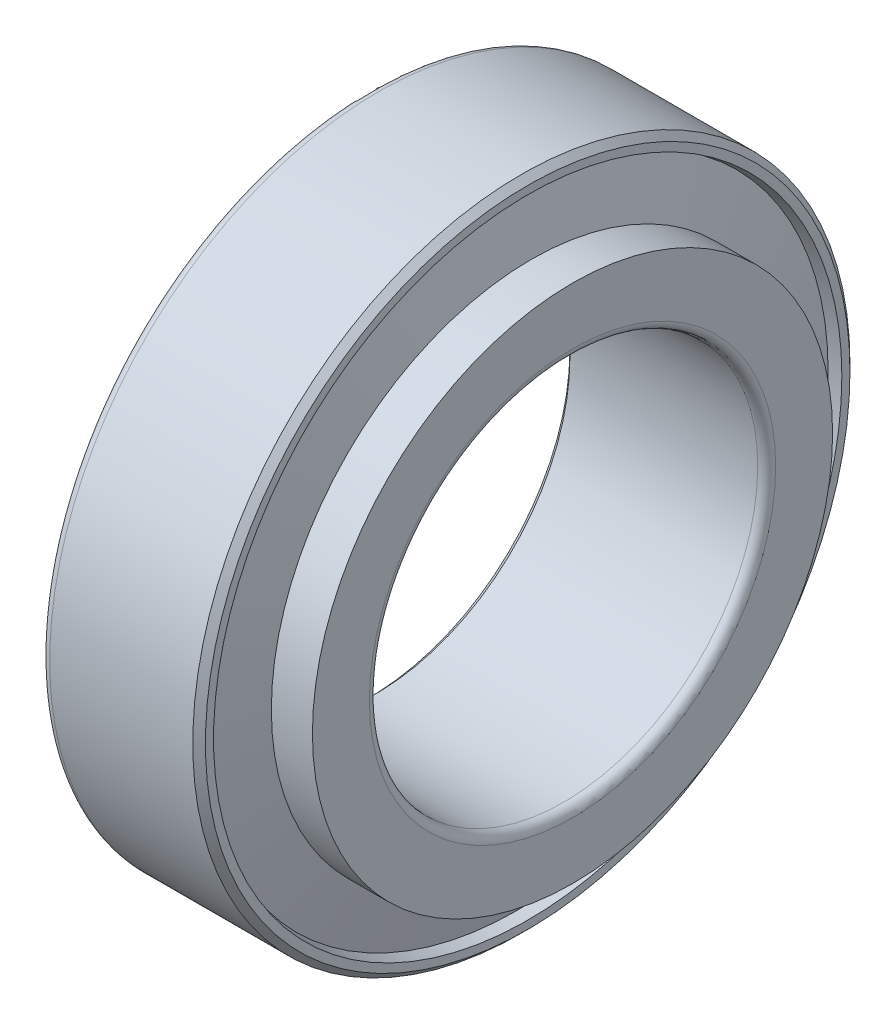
from build123d import *


with BuildPart() as part:
    # OutRacSke → OuterRace (revolve)
    with BuildSketch(Plane.XY, mode=Mode.PRIVATE) as outerrace_sk:
        with BuildLine():
            Line((-7.5, 52.581765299), (-34, 45.827))
            Line((-34, 45.827), (-34, 53.5))
            ThreePointArc((-34, 53.5), (-33.560660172, 54.560660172), (-32.5, 55))
            Line((-32.5, 55), (-8.56, 55))
            Line((-8.56, 55), (-7.5, 53.94))
            Line((-7.5, 53.94), (-7.5, 52.581765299))
        make_face()
    revolve(outerrace_sk.sketch.rotate(Axis((-42.5, 0, 0), (1, 0, 0)), 270), axis=Axis((-42.5, 0, 0), (1, 0, 0)))

    # RolSimSke → RollersSimplified (revolve)
    with BuildSketch(Plane.XY, mode=Mode.PRIVATE) as rollerssimplified_sk:
        Polygon((-32.5, 46.440391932), (-9.388974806, 52.331318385), (-6.888109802, 42.520034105), (-29.999134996, 36.629107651), align=None)
    revolve(rollerssimplified_sk.sketch.rotate(Axis((0, 0, 0), (-1, 0, 0)), 90), axis=Axis((0, 0, 0), (-1, 0, 0)))

    # InsRacSke → InnerRace (revolve)
    with BuildSketch(Plane.XY, mode=Mode.PRIVATE) as innerrace_sk:
        with BuildLine():
            Line((-30.115672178, 37.135357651), (-34, 37.135357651))
            Line((-34, 37.135357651), (-34, 33.56))
            Line((-34, 33.56), (-32.94, 32.5))
            Line((-32.94, 32.5), (-1.5, 32.5))
            ThreePointArc((-1.5, 32.5), (-0.439339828, 32.939339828), (0, 34))
            Line((0, 34), (0, 43.532534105))
            Line((0, 43.532534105), (-6.875605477, 43.532534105))
            Line((-6.875605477, 43.532534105), (-6.875605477, 42.520034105))
            Line((-6.875605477, 42.520034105), (-29.986630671, 36.629107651))
            Line((-29.986630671, 36.629107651), (-30.115672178, 37.135357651))
        make_face()
    revolve(innerrace_sk.sketch.rotate(Axis((-42.5, 0, 0), (1, 0, 0)), 270), axis=Axis((-42.5, 0, 0), (1, 0, 0)))


solid = part.part
